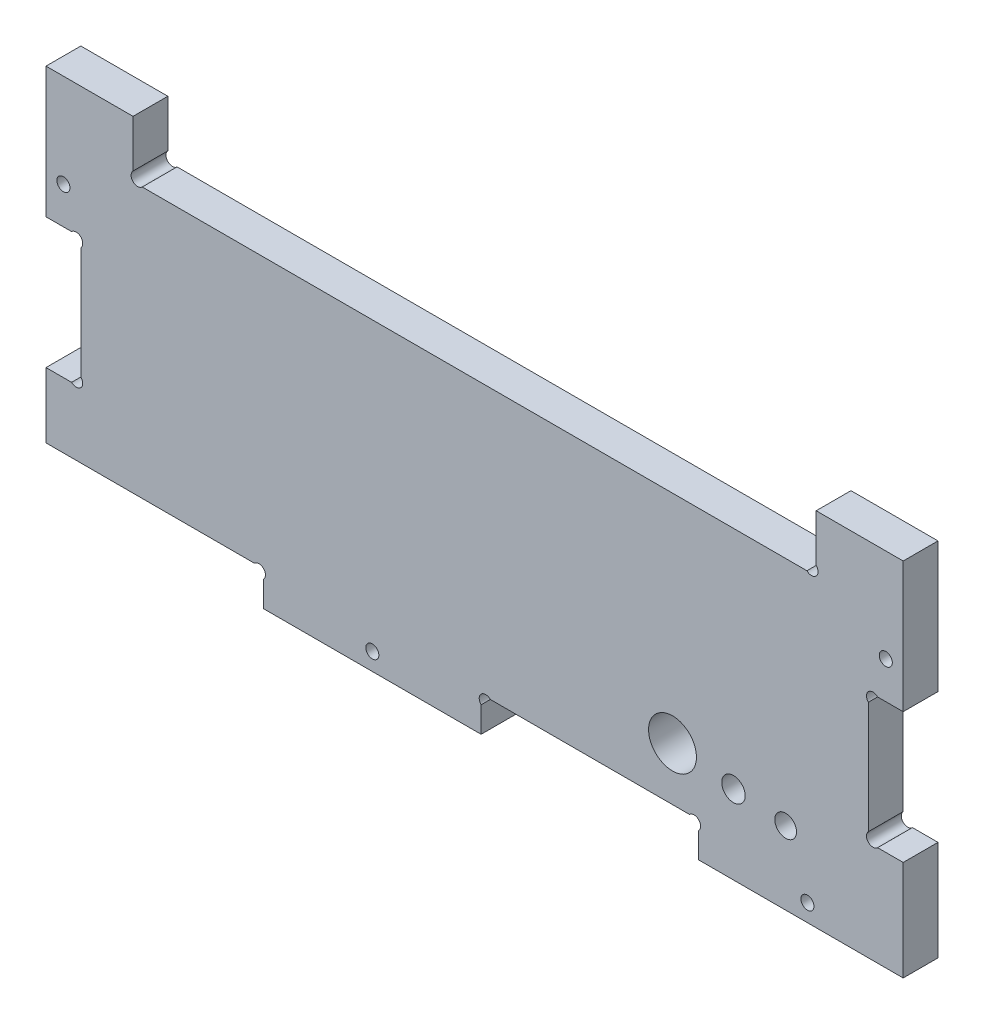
from build123d import *

# Parameters (mm, degrees)
ESQUISSE1_R        = 5.5
ESQUISSE1_R_2      = 2.7
ESQUISSE1_R_3      = 2.5
ESQUISSE1_R_4      = 1.5
BOSS_EXTRU_1_DEPTH = 8


with BuildPart() as part:
    # Esquisse1 → Boss.-Extru.1 (new body)
    with BuildSketch(Plane.XY):
        with BuildLine():
            Line((-176.815675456, 28.383111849), (-176.815675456, 45.383111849))
            Line((-176.815675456, 45.383111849), (-176.815675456, 58.383111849))
            Line((-176.815675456, 58.383111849), (-156.815675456, 58.383111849))
            Line((-156.815675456, 58.383111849), (-156.815675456, 47.504432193))
            ThreePointArc((-156.815675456, 47.504432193), (-156.815675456, 45.383111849), (-154.694355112, 45.383111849))
            Line((-154.694355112, 45.383111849), (-1.936995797, 45.383111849))
            ThreePointArc((-1.936995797, 45.383111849), (0.184324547, 45.383111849), (0.184324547, 47.504432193))
            Line((0.184324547, 47.504432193), (0.184324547, 58.383111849))
            Line((0.184324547, 58.383111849), (20.184324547, 58.383111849))
            Line((20.184324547, 58.383111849), (20.184324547, 45.383111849))
            Line((20.184324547, 45.383111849), (20.184324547, 28.383111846))
            Line((20.184324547, 28.383111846), (14.30564489, 28.383111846))
            ThreePointArc((14.30564489, 28.383111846), (12.184324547, 28.383111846), (12.184324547, 26.261791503))
            Line((12.184324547, 26.261791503), (12.184324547, 0.50443219))
            ThreePointArc((12.184324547, 0.50443219), (12.184324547, -1.616888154), (14.30564489, -1.616888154))
            Line((14.30564489, -1.616888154), (20.184324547, -1.616888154))
            Line((20.184324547, -1.616888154), (20.184324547, -18.738208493))
            Line((20.184324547, -18.738208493), (20.184324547, -24.616888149))
            Line((20.184324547, -24.616888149), (-26.815675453, -24.616888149))
            Line((-26.815675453, -24.616888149), (-26.815675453, -18.738208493))
            ThreePointArc((-26.815675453, -18.738208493), (-26.815675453, -16.616888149), (-28.936995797, -16.616888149))
            Line((-28.936995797, -16.616888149), (-74.69435511, -16.616888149))
            ThreePointArc((-74.69435511, -16.616888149), (-76.815675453, -16.616888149), (-76.815675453, -18.738208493))
            Line((-76.815675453, -18.738208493), (-76.815675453, -24.616888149))
            Line((-76.815675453, -24.616888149), (-126.815675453, -24.616888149))
            Line((-126.815675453, -24.616888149), (-126.815675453, -18.738208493))
            ThreePointArc((-126.815675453, -18.738208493), (-126.815675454, -16.61688815), (-128.936995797, -16.616888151))
            Line((-128.936995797, -16.616888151), (-176.815675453, -16.616888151))
            Line((-176.815675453, -16.616888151), (-176.815675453, -1.616888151))
            Line((-176.815675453, -1.616888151), (-170.936995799, -1.616888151))
            ThreePointArc((-170.936995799, -1.616888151), (-168.815675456, -1.616888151), (-168.815675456, 0.504432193))
            Line((-168.815675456, 0.504432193), (-168.815675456, 26.261791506))
            ThreePointArc((-168.815675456, 26.261791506), (-168.815675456, 28.383111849), (-170.936995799, 28.383111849))
            Line((-170.936995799, 28.383111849), (-176.815675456, 28.383111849))
        make_face()
        with Locations((-32.834318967, -4.426888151)):
            Circle(ESQUISSE1_R, mode=Mode.SUBTRACT)
        with Locations((-18.817975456, -6.516888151)):
            Circle(ESQUISSE1_R_2, mode=Mode.SUBTRACT)
        with Locations((-6.82870162, -7.816888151)):
            Circle(ESQUISSE1_R_3, mode=Mode.SUBTRACT)
        with Locations((16.184324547, 36.883111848)):
            Circle(ESQUISSE1_R_4, mode=Mode.SUBTRACT)
        with Locations((-101.815675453, -20.616888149)):
            Circle(ESQUISSE1_R_4, mode=Mode.SUBTRACT)
        with Locations((-1.815675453, -20.616888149)):
            Circle(ESQUISSE1_R_4, mode=Mode.SUBTRACT)
        with Locations((-172.815675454, 36.883111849)):
            Circle(ESQUISSE1_R_4, mode=Mode.SUBTRACT)
    extrude(amount=BOSS_EXTRU_1_DEPTH)


solid = part.part
